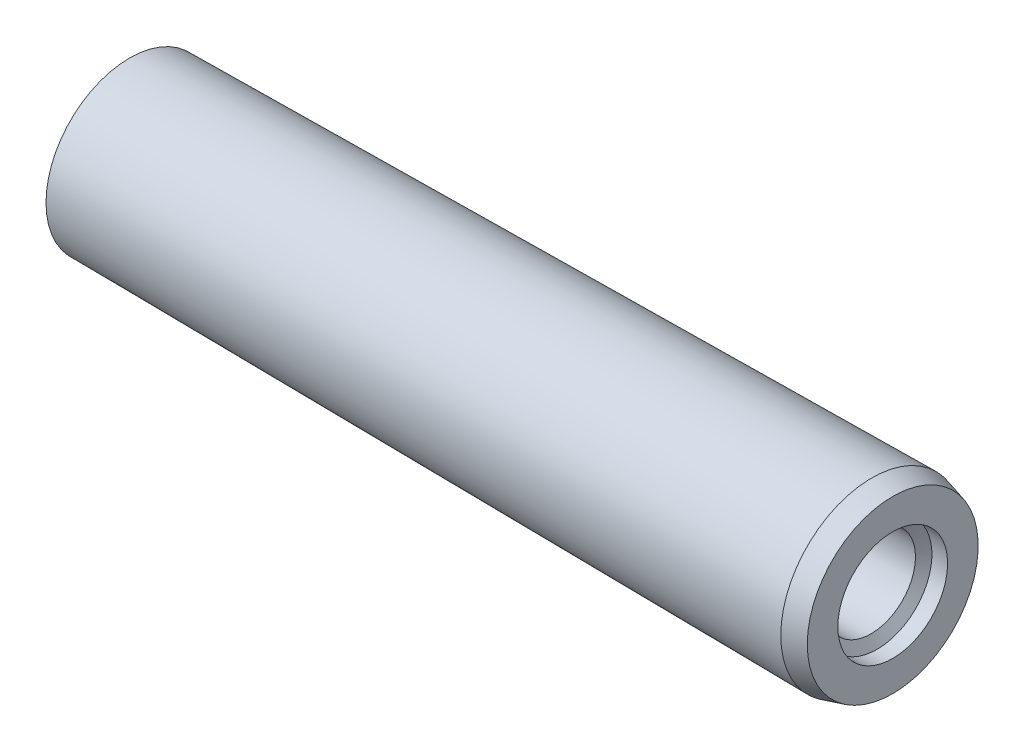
from build123d import *


with BuildPart() as part:
    # BodySke → Body (revolve)
    with BuildSketch(Plane.XY, mode=Mode.PRIVATE) as body_sk:
        with BuildLine():
            Line((2, 8), (73, 8.709999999))
            Line((73, 8.709999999), (75, 8.174101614))
            Line((75, 8.174101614), (75, 5.25))
            Line((75, 5.25), (73.5, 5.25))
            Line((73.5, 5.25), (72.922649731, 4.25))
            Line((72.922649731, 4.25), (50, 4.25))
            Line((50, 4.25), (48.23959236, 0))
            Line((48.23959236, 0), (0, 0))
            ThreePointArc((0, 0), (0.507577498, 4.123105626), (2, 8))
        make_face()
    revolve(body_sk.sketch.rotate(Axis((0, 0, 0), (1, 0, 0)), 90), axis=Axis((0, 0, 0), (1, 0, 0)))


solid = part.part
